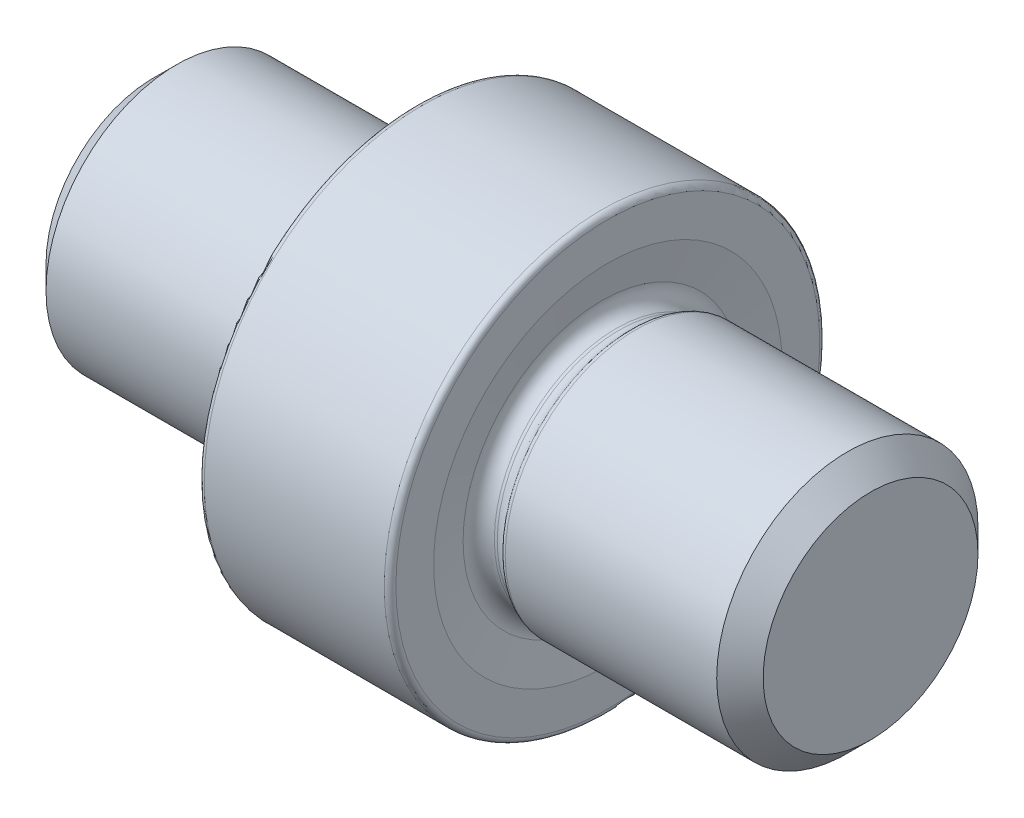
ISO-10303-21;
HEADER;
FILE_DESCRIPTION(('STEP AP214'),'2;1');
FILE_NAME('part.step','',(''),(''),'','','');
FILE_SCHEMA(('AUTOMOTIVE_DESIGN { 1 0 10303 214 1 1 1 1 }'));
ENDSEC;
DATA;
#1=APPLICATION_CONTEXT('core data for automotive mechanical design processes');
#2=APPLICATION_PROTOCOL_DEFINITION('international standard','automotive_design',2000,#1);
#3=PRODUCT_CONTEXT('',#1,'mechanical');
#4=PRODUCT('Part','Part','',(#3));
#5=PRODUCT_RELATED_PRODUCT_CATEGORY('part','',(#4));
#6=PRODUCT_DEFINITION_FORMATION('','',#4);
#7=PRODUCT_DEFINITION_CONTEXT('part definition',#1,'design');
#8=PRODUCT_DEFINITION('design','',#6,#7);
#9=PRODUCT_DEFINITION_SHAPE('','',#8);
#10=(LENGTH_UNIT() NAMED_UNIT(*) SI_UNIT(.MILLI.,.METRE.));
#11=(NAMED_UNIT(*) PLANE_ANGLE_UNIT() SI_UNIT($,.RADIAN.));
#12=(NAMED_UNIT(*) SI_UNIT($,.STERADIAN.) SOLID_ANGLE_UNIT());
#13=UNCERTAINTY_MEASURE_WITH_UNIT(LENGTH_MEASURE(1.E-05),#10,'distance_accuracy_value','');
#14=(GEOMETRIC_REPRESENTATION_CONTEXT(3) GLOBAL_UNCERTAINTY_ASSIGNED_CONTEXT((#13)) GLOBAL_UNIT_ASSIGNED_CONTEXT((#10,
#11,#12)) REPRESENTATION_CONTEXT('',''));
#15=CARTESIAN_POINT('',(0.,0.,0.));
#16=DIRECTION('',(0.,0.,1.));
#17=DIRECTION('',(1.,0.,0.));
#18=AXIS2_PLACEMENT_3D('',#15,#16,#17);
#19=CARTESIAN_POINT('',(12.35,4.5,0.));
#20=DIRECTION('',(1.,0.,0.));
#21=DIRECTION('',(0.,0.,-1.));
#22=AXIS2_PLACEMENT_3D('',#19,#20,#21);
#23=PLANE('',#22);
#24=CARTESIAN_POINT('',(12.35,0.,0.));
#25=DIRECTION('',(1.,0.,0.));
#26=DIRECTION('',(0.,0.,-1.));
#27=AXIS2_PLACEMENT_3D('',#24,#25,#26);
#28=CIRCLE('',#27,3.7);
#29=CARTESIAN_POINT('',(12.35,0.,-3.7));
#30=VERTEX_POINT('',#29);
#31=EDGE_CURVE('E63',#30,#30,#28,.T.);
#32=ORIENTED_EDGE('',*,*,#31,.T.);
#33=EDGE_LOOP('',(#32));
#34=FACE_BOUND('',#33,.T.);
#35=ADVANCED_FACE('F34',(#34),#23,.T.);
#36=CARTESIAN_POINT('',(-12.35,4.5,0.));
#37=DIRECTION('',(-1.,0.,0.));
#38=DIRECTION('',(0.,0.,1.));
#39=AXIS2_PLACEMENT_3D('',#36,#37,#38);
#40=PLANE('',#39);
#41=CARTESIAN_POINT('',(-12.35,0.,0.));
#42=DIRECTION('',(-1.,0.,0.));
#43=DIRECTION('',(0.,0.,1.));
#44=AXIS2_PLACEMENT_3D('',#41,#42,#43);
#45=CIRCLE('',#44,3.70000000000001);
#46=CARTESIAN_POINT('',(-12.35,0.,3.70000000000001));
#47=VERTEX_POINT('',#46);
#48=EDGE_CURVE('E54',#47,#47,#45,.T.);
#49=ORIENTED_EDGE('',*,*,#48,.T.);
#50=EDGE_LOOP('',(#49));
#51=FACE_BOUND('',#50,.T.);
#52=ADVANCED_FACE('F120',(#51),#40,.T.);
#53=CARTESIAN_POINT('',(12.35,0.,0.));
#54=DIRECTION('',(1.,0.,0.));
#55=DIRECTION('',(0.,0.,-1.));
#56=AXIS2_PLACEMENT_3D('',#53,#54,#55);
#57=CYLINDRICAL_SURFACE('',#56,4.50000000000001);
#58=CARTESIAN_POINT('',(-11.55,0.,0.));
#59=DIRECTION('',(-1.,0.,0.));
#60=DIRECTION('',(0.,0.,1.));
#61=AXIS2_PLACEMENT_3D('',#58,#59,#60);
#62=CIRCLE('',#61,4.50000000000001);
#63=CARTESIAN_POINT('',(-11.55,0.,4.50000000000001));
#64=VERTEX_POINT('',#63);
#65=EDGE_CURVE('E57',#64,#64,#62,.F.);
#66=ORIENTED_EDGE('',*,*,#65,.T.);
#67=EDGE_LOOP('',(#66));
#68=FACE_BOUND('',#67,.T.);
#69=CARTESIAN_POINT('',(-4.26619869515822,0.,0.));
#70=DIRECTION('',(-1.,0.,0.));
#71=DIRECTION('',(0.,0.,1.));
#72=AXIS2_PLACEMENT_3D('',#69,#70,#71);
#73=CIRCLE('',#72,4.50000000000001);
#74=CARTESIAN_POINT('',(-4.26619869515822,0.,4.50000000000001));
#75=VERTEX_POINT('',#74);
#76=EDGE_CURVE('E72',#75,#75,#73,.T.);
#77=ORIENTED_EDGE('',*,*,#76,.T.);
#78=EDGE_LOOP('',(#77));
#79=FACE_BOUND('',#78,.T.);
#80=ADVANCED_FACE('F126',(#68,#79),#57,.T.);
#81=CARTESIAN_POINT('',(12.35,0.,0.));
#82=DIRECTION('',(1.,0.,0.));
#83=DIRECTION('',(0.,0.,-1.));
#84=AXIS2_PLACEMENT_3D('',#81,#82,#83);
#85=CYLINDRICAL_SURFACE('',#84,4.20000000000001);
#86=CARTESIAN_POINT('',(-3.69174243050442,0.,0.));
#87=DIRECTION('',(-1.,0.,0.));
#88=DIRECTION('',(0.,0.,1.));
#89=AXIS2_PLACEMENT_3D('',#86,#87,#88);
#90=CIRCLE('',#89,4.20000000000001);
#91=CARTESIAN_POINT('',(-3.69174243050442,0.,4.20000000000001));
#92=VERTEX_POINT('',#91);
#93=EDGE_CURVE('E90',#92,#92,#90,.F.);
#94=ORIENTED_EDGE('',*,*,#93,.T.);
#95=EDGE_LOOP('',(#94));
#96=FACE_BOUND('',#95,.T.);
#97=CARTESIAN_POINT('',(-3.59023021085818,0.,0.));
#98=DIRECTION('',(1.,0.,0.));
#99=DIRECTION('',(0.,0.,-1.));
#100=AXIS2_PLACEMENT_3D('',#97,#98,#99);
#101=CIRCLE('',#100,4.20000000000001);
#102=CARTESIAN_POINT('',(-3.59023021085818,0.,-4.20000000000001));
#103=VERTEX_POINT('',#102);
#104=EDGE_CURVE('E93',#103,#103,#101,.F.);
#105=ORIENTED_EDGE('',*,*,#104,.T.);
#106=EDGE_LOOP('',(#105));
#107=FACE_BOUND('',#106,.T.);
#108=ADVANCED_FACE('F238',(#96,#107),#85,.T.);
#109=CARTESIAN_POINT('',(-3.3,0.,0.));
#110=DIRECTION('',(-1.,0.,0.));
#111=DIRECTION('',(0.,0.,1.));
#112=AXIS2_PLACEMENT_3D('',#109,#110,#111);
#113=CONICAL_SURFACE('',#112,6.00000000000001,1.40564764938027);
#114=CARTESIAN_POINT('',(-3.09703324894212,0.,0.));
#115=DIRECTION('',(-1.,0.,0.));
#116=DIRECTION('',(0.,0.,1.));
#117=AXIS2_PLACEMENT_3D('',#114,#115,#116);
#118=CIRCLE('',#117,4.78219949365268);
#119=CARTESIAN_POINT('',(-3.09703324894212,0.,4.78219949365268));
#120=VERTEX_POINT('',#119);
#121=EDGE_CURVE('E81',#120,#120,#118,.F.);
#122=ORIENTED_EDGE('',*,*,#121,.T.);
#123=EDGE_LOOP('',(#122));
#124=FACE_BOUND('',#123,.T.);
#125=CARTESIAN_POINT('',(-3.3,0.,0.));
#126=DIRECTION('',(1.,0.,0.));
#127=DIRECTION('',(0.,0.,-1.));
#128=AXIS2_PLACEMENT_3D('',#125,#126,#127);
#129=CIRCLE('',#128,6.00000000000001);
#130=CARTESIAN_POINT('',(-3.3,0.,-6.00000000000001));
#131=VERTEX_POINT('',#130);
#132=EDGE_CURVE('E96',#131,#131,#129,.T.);
#133=ORIENTED_EDGE('',*,*,#132,.F.);
#134=EDGE_LOOP('',(#133));
#135=FACE_BOUND('',#134,.T.);
#136=ADVANCED_FACE('F203',(#124,#135),#113,.F.);
#137=CARTESIAN_POINT('',(-3.3,7.5,0.));
#138=DIRECTION('',(-1.,0.,0.));
#139=DIRECTION('',(0.,0.,1.));
#140=AXIS2_PLACEMENT_3D('',#137,#138,#139);
#141=PLANE('',#140);
#142=CARTESIAN_POINT('',(-3.3,0.,0.));
#143=DIRECTION('',(-1.,0.,0.));
#144=DIRECTION('',(0.,0.,1.));
#145=AXIS2_PLACEMENT_3D('',#142,#143,#144);
#146=CIRCLE('',#145,7.30000000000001);
#147=CARTESIAN_POINT('',(-3.3,0.,7.30000000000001));
#148=VERTEX_POINT('',#147);
#149=EDGE_CURVE('E10',#148,#148,#146,.T.);
#150=ORIENTED_EDGE('',*,*,#149,.T.);
#151=EDGE_LOOP('',(#150));
#152=FACE_BOUND('',#151,.T.);
#153=ORIENTED_EDGE('',*,*,#132,.T.);
#154=EDGE_LOOP('',(#153));
#155=FACE_BOUND('',#154,.T.);
#156=ADVANCED_FACE('F117',(#152,#155),#141,.T.);
#157=CARTESIAN_POINT('',(12.35,0.,0.));
#158=DIRECTION('',(1.,0.,0.));
#159=DIRECTION('',(0.,0.,-1.));
#160=AXIS2_PLACEMENT_3D('',#157,#158,#159);
#161=CYLINDRICAL_SURFACE('',#160,7.50000000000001);
#162=CARTESIAN_POINT('',(3.1,0.,0.));
#163=DIRECTION('',(1.,0.,0.));
#164=DIRECTION('',(0.,0.,-1.));
#165=AXIS2_PLACEMENT_3D('',#162,#163,#164);
#166=CIRCLE('',#165,7.50000000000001);
#167=CARTESIAN_POINT('',(3.1,0.,-7.50000000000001));
#168=VERTEX_POINT('',#167);
#169=EDGE_CURVE('E41',#168,#168,#166,.F.);
#170=ORIENTED_EDGE('',*,*,#169,.T.);
#171=EDGE_LOOP('',(#170));
#172=FACE_BOUND('',#171,.T.);
#173=CARTESIAN_POINT('',(-3.1,0.,0.));
#174=DIRECTION('',(-1.,0.,0.));
#175=DIRECTION('',(0.,0.,1.));
#176=AXIS2_PLACEMENT_3D('',#173,#174,#175);
#177=CIRCLE('',#176,7.50000000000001);
#178=CARTESIAN_POINT('',(-3.1,0.,7.50000000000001));
#179=VERTEX_POINT('',#178);
#180=EDGE_CURVE('E45',#179,#179,#177,.F.);
#181=ORIENTED_EDGE('',*,*,#180,.T.);
#182=EDGE_LOOP('',(#181));
#183=FACE_BOUND('',#182,.T.);
#184=ADVANCED_FACE('F107',(#172,#183),#161,.T.);
#185=CARTESIAN_POINT('',(3.3,7.5,0.));
#186=DIRECTION('',(1.,0.,0.));
#187=DIRECTION('',(0.,0.,-1.));
#188=AXIS2_PLACEMENT_3D('',#185,#186,#187);
#189=PLANE('',#188);
#190=CARTESIAN_POINT('',(3.3,0.,0.));
#191=DIRECTION('',(1.,0.,0.));
#192=DIRECTION('',(0.,0.,-1.));
#193=AXIS2_PLACEMENT_3D('',#190,#191,#192);
#194=CIRCLE('',#193,7.30000000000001);
#195=CARTESIAN_POINT('',(3.3,0.,-7.30000000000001));
#196=VERTEX_POINT('',#195);
#197=EDGE_CURVE('E49',#196,#196,#194,.T.);
#198=ORIENTED_EDGE('',*,*,#197,.T.);
#199=EDGE_LOOP('',(#198));
#200=FACE_BOUND('',#199,.T.);
#201=CARTESIAN_POINT('',(3.3,0.,0.));
#202=DIRECTION('',(1.,0.,0.));
#203=DIRECTION('',(0.,0.,-1.));
#204=AXIS2_PLACEMENT_3D('',#201,#202,#203);
#205=CIRCLE('',#204,6.00000000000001);
#206=CARTESIAN_POINT('',(3.3,0.,-6.00000000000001));
#207=VERTEX_POINT('',#206);
#208=EDGE_CURVE('E99',#207,#207,#205,.T.);
#209=ORIENTED_EDGE('',*,*,#208,.F.);
#210=EDGE_LOOP('',(#209));
#211=FACE_BOUND('',#210,.T.);
#212=ADVANCED_FACE('F105',(#200,#211),#189,.T.);
#213=CARTESIAN_POINT('',(3.,0.,0.));
#214=DIRECTION('',(1.,0.,0.));
#215=DIRECTION('',(0.,0.,-1.));
#216=AXIS2_PLACEMENT_3D('',#213,#214,#215);
#217=CONICAL_SURFACE('',#216,4.20000000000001,1.40564764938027);
#218=CARTESIAN_POINT('',(3.09703324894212,0.,0.));
#219=DIRECTION('',(1.,0.,0.));
#220=DIRECTION('',(0.,0.,-1.));
#221=AXIS2_PLACEMENT_3D('',#218,#219,#220);
#222=CIRCLE('',#221,4.78219949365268);
#223=CARTESIAN_POINT('',(3.09703324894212,0.,-4.78219949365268));
#224=VERTEX_POINT('',#223);
#225=EDGE_CURVE('E78',#224,#224,#222,.F.);
#226=ORIENTED_EDGE('',*,*,#225,.T.);
#227=EDGE_LOOP('',(#226));
#228=FACE_BOUND('',#227,.T.);
#229=ORIENTED_EDGE('',*,*,#208,.T.);
#230=EDGE_LOOP('',(#229));
#231=FACE_BOUND('',#230,.T.);
#232=ADVANCED_FACE('F103',(#228,#231),#217,.F.);
#233=CARTESIAN_POINT('',(12.35,0.,0.));
#234=DIRECTION('',(1.,0.,0.));
#235=DIRECTION('',(0.,0.,-1.));
#236=AXIS2_PLACEMENT_3D('',#233,#234,#235);
#237=CYLINDRICAL_SURFACE('',#236,4.20000000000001);
#238=CARTESIAN_POINT('',(3.69174243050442,0.,0.));
#239=DIRECTION('',(1.,0.,0.));
#240=DIRECTION('',(0.,0.,-1.));
#241=AXIS2_PLACEMENT_3D('',#238,#239,#240);
#242=CIRCLE('',#241,4.20000000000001);
#243=CARTESIAN_POINT('',(3.69174243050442,0.,-4.20000000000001));
#244=VERTEX_POINT('',#243);
#245=EDGE_CURVE('E84',#244,#244,#242,.F.);
#246=ORIENTED_EDGE('',*,*,#245,.T.);
#247=EDGE_LOOP('',(#246));
#248=FACE_BOUND('',#247,.T.);
#249=CARTESIAN_POINT('',(3.59023021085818,0.,0.));
#250=DIRECTION('',(1.,0.,0.));
#251=DIRECTION('',(0.,0.,-1.));
#252=AXIS2_PLACEMENT_3D('',#249,#250,#251);
#253=CIRCLE('',#252,4.20000000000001);
#254=CARTESIAN_POINT('',(3.59023021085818,0.,-4.20000000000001));
#255=VERTEX_POINT('',#254);
#256=EDGE_CURVE('E87',#255,#255,#253,.T.);
#257=ORIENTED_EDGE('',*,*,#256,.T.);
#258=EDGE_LOOP('',(#257));
#259=FACE_BOUND('',#258,.T.);
#260=ADVANCED_FACE('F114',(#248,#259),#237,.T.);
#261=CARTESIAN_POINT('',(12.35,0.,0.));
#262=DIRECTION('',(1.,0.,0.));
#263=DIRECTION('',(0.,0.,-1.));
#264=AXIS2_PLACEMENT_3D('',#261,#262,#263);
#265=CYLINDRICAL_SURFACE('',#264,4.50000000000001);
#266=CARTESIAN_POINT('',(11.55,0.,0.));
#267=DIRECTION('',(1.,0.,0.));
#268=DIRECTION('',(0.,0.,-1.));
#269=AXIS2_PLACEMENT_3D('',#266,#267,#268);
#270=CIRCLE('',#269,4.50000000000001);
#271=CARTESIAN_POINT('',(11.55,0.,-4.50000000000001));
#272=VERTEX_POINT('',#271);
#273=EDGE_CURVE('E60',#272,#272,#270,.F.);
#274=ORIENTED_EDGE('',*,*,#273,.T.);
#275=EDGE_LOOP('',(#274));
#276=FACE_BOUND('',#275,.T.);
#277=CARTESIAN_POINT('',(4.26619869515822,0.,0.));
#278=DIRECTION('',(-1.,0.,0.));
#279=DIRECTION('',(0.,0.,1.));
#280=AXIS2_PLACEMENT_3D('',#277,#278,#279);
#281=CIRCLE('',#280,4.50000000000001);
#282=CARTESIAN_POINT('',(4.26619869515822,0.,4.50000000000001));
#283=VERTEX_POINT('',#282);
#284=EDGE_CURVE('E69',#283,#283,#281,.F.);
#285=ORIENTED_EDGE('',*,*,#284,.T.);
#286=EDGE_LOOP('',(#285));
#287=FACE_BOUND('',#286,.T.);
#288=ADVANCED_FACE('F135',(#276,#287),#265,.T.);
#289=CARTESIAN_POINT('',(-3.69174243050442,0.,0.));
#290=DIRECTION('',(-1.,0.,0.));
#291=DIRECTION('',(0.,0.,1.));
#292=AXIS2_PLACEMENT_3D('',#289,#290,#291);
#293=TOROIDAL_SURFACE('',#292,4.70000000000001,0.5);
#294=CARTESIAN_POINT('',(-4.10206833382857,0.,0.));
#295=DIRECTION('',(1.,0.,0.));
#296=DIRECTION('',(0.,0.,-1.));
#297=AXIS2_PLACEMENT_3D('',#294,#295,#296);
#298=CIRCLE('',#297,4.41428571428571);
#299=CARTESIAN_POINT('',(-4.10206833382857,0.,-4.41428571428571));
#300=VERTEX_POINT('',#299);
#301=EDGE_CURVE('E75',#300,#300,#298,.T.);
#302=ORIENTED_EDGE('',*,*,#301,.T.);
#303=EDGE_LOOP('',(#302));
#304=FACE_BOUND('',#303,.T.);
#305=ORIENTED_EDGE('',*,*,#93,.F.);
#306=EDGE_LOOP('',(#305));
#307=FACE_BOUND('',#306,.T.);
#308=ADVANCED_FACE('F131',(#304,#307),#293,.F.);
#309=CARTESIAN_POINT('',(3.69174243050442,0.,0.));
#310=DIRECTION('',(1.,0.,0.));
#311=DIRECTION('',(0.,0.,-1.));
#312=AXIS2_PLACEMENT_3D('',#309,#310,#311);
#313=TOROIDAL_SURFACE('',#312,4.70000000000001,0.5);
#314=CARTESIAN_POINT('',(4.10206833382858,0.,0.));
#315=DIRECTION('',(-1.,0.,0.));
#316=DIRECTION('',(0.,0.,1.));
#317=AXIS2_PLACEMENT_3D('',#314,#315,#316);
#318=CIRCLE('',#317,4.41428571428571);
#319=CARTESIAN_POINT('',(4.10206833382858,0.,4.41428571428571));
#320=VERTEX_POINT('',#319);
#321=EDGE_CURVE('E66',#320,#320,#318,.T.);
#322=ORIENTED_EDGE('',*,*,#321,.T.);
#323=EDGE_LOOP('',(#322));
#324=FACE_BOUND('',#323,.T.);
#325=ORIENTED_EDGE('',*,*,#245,.F.);
#326=EDGE_LOOP('',(#325));
#327=FACE_BOUND('',#326,.T.);
#328=ADVANCED_FACE('F134',(#324,#327),#313,.F.);
#329=CARTESIAN_POINT('',(-3.59023021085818,0.,0.));
#330=DIRECTION('',(1.,0.,0.));
#331=DIRECTION('',(0.,0.,-1.));
#332=AXIS2_PLACEMENT_3D('',#329,#330,#331);
#333=TOROIDAL_SURFACE('',#332,4.70000000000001,0.5);
#334=ORIENTED_EDGE('',*,*,#104,.F.);
#335=EDGE_LOOP('',(#334));
#336=FACE_BOUND('',#335,.T.);
#337=ORIENTED_EDGE('',*,*,#121,.F.);
#338=EDGE_LOOP('',(#337));
#339=FACE_BOUND('',#338,.T.);
#340=ADVANCED_FACE('F139',(#336,#339),#333,.F.);
#341=CARTESIAN_POINT('',(3.59023021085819,0.,0.));
#342=DIRECTION('',(1.,0.,0.));
#343=DIRECTION('',(0.,0.,-1.));
#344=AXIS2_PLACEMENT_3D('',#341,#342,#343);
#345=TOROIDAL_SURFACE('',#344,4.70000000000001,0.5);
#346=ORIENTED_EDGE('',*,*,#225,.F.);
#347=EDGE_LOOP('',(#346));
#348=FACE_BOUND('',#347,.T.);
#349=ORIENTED_EDGE('',*,*,#256,.F.);
#350=EDGE_LOOP('',(#349));
#351=FACE_BOUND('',#350,.T.);
#352=ADVANCED_FACE('F143',(#348,#351),#345,.F.);
#353=CARTESIAN_POINT('',(-4.26619869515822,0.,0.));
#354=DIRECTION('',(-1.,0.,0.));
#355=DIRECTION('',(0.,0.,1.));
#356=AXIS2_PLACEMENT_3D('',#353,#354,#355);
#357=TOROIDAL_SURFACE('',#356,4.30000000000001,0.2);
#358=ORIENTED_EDGE('',*,*,#76,.F.);
#359=EDGE_LOOP('',(#358));
#360=FACE_BOUND('',#359,.T.);
#361=ORIENTED_EDGE('',*,*,#301,.F.);
#362=EDGE_LOOP('',(#361));
#363=FACE_BOUND('',#362,.T.);
#364=ADVANCED_FACE('F147',(#360,#363),#357,.T.);
#365=CARTESIAN_POINT('',(4.26619869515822,0.,0.));
#366=DIRECTION('',(-1.,0.,0.));
#367=DIRECTION('',(0.,0.,1.));
#368=AXIS2_PLACEMENT_3D('',#365,#366,#367);
#369=TOROIDAL_SURFACE('',#368,4.30000000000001,0.2);
#370=ORIENTED_EDGE('',*,*,#321,.F.);
#371=EDGE_LOOP('',(#370));
#372=FACE_BOUND('',#371,.T.);
#373=ORIENTED_EDGE('',*,*,#284,.F.);
#374=EDGE_LOOP('',(#373));
#375=FACE_BOUND('',#374,.T.);
#376=ADVANCED_FACE('F151',(#372,#375),#369,.T.);
#377=CARTESIAN_POINT('',(12.35,0.,0.));
#378=DIRECTION('',(-1.,0.,0.));
#379=DIRECTION('',(0.,0.,1.));
#380=AXIS2_PLACEMENT_3D('',#377,#378,#379);
#381=CONICAL_SURFACE('',#380,3.7,0.785398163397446);
#382=ORIENTED_EDGE('',*,*,#273,.F.);
#383=EDGE_LOOP('',(#382));
#384=FACE_BOUND('',#383,.T.);
#385=ORIENTED_EDGE('',*,*,#31,.F.);
#386=EDGE_LOOP('',(#385));
#387=FACE_BOUND('',#386,.T.);
#388=ADVANCED_FACE('F155',(#384,#387),#381,.T.);
#389=CARTESIAN_POINT('',(-11.55,0.,0.));
#390=DIRECTION('',(1.,0.,0.));
#391=DIRECTION('',(0.,0.,-1.));
#392=AXIS2_PLACEMENT_3D('',#389,#390,#391);
#393=CONICAL_SURFACE('',#392,4.50000000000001,0.785398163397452);
#394=ORIENTED_EDGE('',*,*,#48,.F.);
#395=EDGE_LOOP('',(#394));
#396=FACE_BOUND('',#395,.T.);
#397=ORIENTED_EDGE('',*,*,#65,.F.);
#398=EDGE_LOOP('',(#397));
#399=FACE_BOUND('',#398,.T.);
#400=ADVANCED_FACE('F159',(#396,#399),#393,.T.);
#401=CARTESIAN_POINT('',(3.1,0.,0.));
#402=DIRECTION('',(1.,0.,0.));
#403=DIRECTION('',(0.,0.,-1.));
#404=AXIS2_PLACEMENT_3D('',#401,#402,#403);
#405=TOROIDAL_SURFACE('',#404,7.30000000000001,0.2);
#406=ORIENTED_EDGE('',*,*,#169,.F.);
#407=EDGE_LOOP('',(#406));
#408=FACE_BOUND('',#407,.T.);
#409=ORIENTED_EDGE('',*,*,#197,.F.);
#410=EDGE_LOOP('',(#409));
#411=FACE_BOUND('',#410,.T.);
#412=ADVANCED_FACE('F162',(#408,#411),#405,.T.);
#413=CARTESIAN_POINT('',(-3.1,0.,0.));
#414=DIRECTION('',(-1.,0.,0.));
#415=DIRECTION('',(0.,0.,1.));
#416=AXIS2_PLACEMENT_3D('',#413,#414,#415);
#417=TOROIDAL_SURFACE('',#416,7.30000000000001,0.2);
#418=ORIENTED_EDGE('',*,*,#149,.F.);
#419=EDGE_LOOP('',(#418));
#420=FACE_BOUND('',#419,.T.);
#421=ORIENTED_EDGE('',*,*,#180,.F.);
#422=EDGE_LOOP('',(#421));
#423=FACE_BOUND('',#422,.T.);
#424=ADVANCED_FACE('F36',(#420,#423),#417,.T.);
#425=CLOSED_SHELL('',(#35,#52,#80,#108,#136,#156,#184,#212,#232,#260,#288,#308,#328,#340,#352,
#364,#376,#388,#400,#412,#424));
#426=MANIFOLD_SOLID_BREP('B2',#425);
#427=ADVANCED_BREP_SHAPE_REPRESENTATION('',(#18,#426),#14);
#428=SHAPE_DEFINITION_REPRESENTATION(#9,#427);
ENDSEC;
END-ISO-10303-21;
